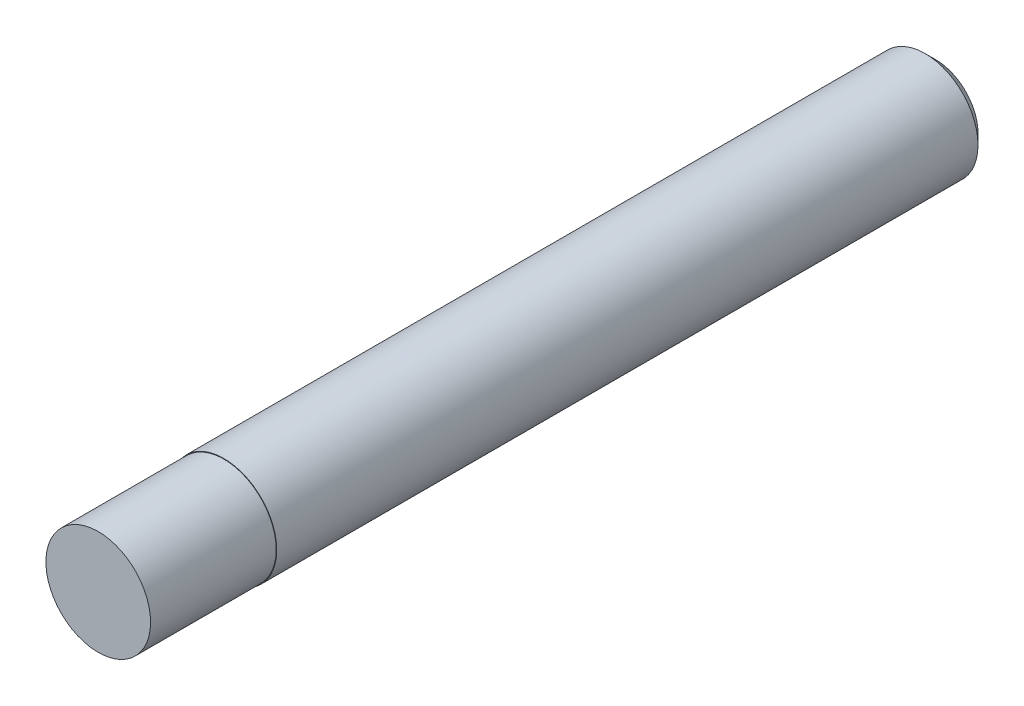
ISO-10303-21;
HEADER;
FILE_DESCRIPTION(('STEP AP214'),'2;1');
FILE_NAME('part.step','',(''),(''),'','','');
FILE_SCHEMA(('AUTOMOTIVE_DESIGN { 1 0 10303 214 1 1 1 1 }'));
ENDSEC;
DATA;
#1=APPLICATION_CONTEXT('core data for automotive mechanical design processes');
#2=APPLICATION_PROTOCOL_DEFINITION('international standard','automotive_design',2000,#1);
#3=PRODUCT_CONTEXT('',#1,'mechanical');
#4=PRODUCT('Part','Part','',(#3));
#5=PRODUCT_RELATED_PRODUCT_CATEGORY('part','',(#4));
#6=PRODUCT_DEFINITION_FORMATION('','',#4);
#7=PRODUCT_DEFINITION_CONTEXT('part definition',#1,'design');
#8=PRODUCT_DEFINITION('design','',#6,#7);
#9=PRODUCT_DEFINITION_SHAPE('','',#8);
#10=(LENGTH_UNIT() NAMED_UNIT(*) SI_UNIT(.MILLI.,.METRE.));
#11=(NAMED_UNIT(*) PLANE_ANGLE_UNIT() SI_UNIT($,.RADIAN.));
#12=(NAMED_UNIT(*) SI_UNIT($,.STERADIAN.) SOLID_ANGLE_UNIT());
#13=UNCERTAINTY_MEASURE_WITH_UNIT(LENGTH_MEASURE(1.E-05),#10,'distance_accuracy_value','');
#14=(GEOMETRIC_REPRESENTATION_CONTEXT(3) GLOBAL_UNCERTAINTY_ASSIGNED_CONTEXT((#13)) GLOBAL_UNIT_ASSIGNED_CONTEXT((#10,
#11,#12)) REPRESENTATION_CONTEXT('',''));
#15=CARTESIAN_POINT('',(0.,0.,0.));
#16=DIRECTION('',(0.,0.,1.));
#17=DIRECTION('',(1.,0.,0.));
#18=AXIS2_PLACEMENT_3D('',#15,#16,#17);
#19=CARTESIAN_POINT('',(0.,0.,34.));
#20=DIRECTION('',(0.,0.,1.));
#21=DIRECTION('',(1.,0.,0.));
#22=AXIS2_PLACEMENT_3D('',#19,#20,#21);
#23=PLANE('',#22);
#24=CARTESIAN_POINT('',(0.,0.,34.));
#25=DIRECTION('',(0.,0.,1.));
#26=DIRECTION('',(1.,0.,0.));
#27=AXIS2_PLACEMENT_3D('',#24,#25,#26);
#28=CIRCLE('',#27,2.525);
#29=CARTESIAN_POINT('',(2.525,0.,34.));
#30=VERTEX_POINT('',#29);
#31=EDGE_CURVE('E46',#30,#30,#28,.T.);
#32=ORIENTED_EDGE('',*,*,#31,.T.);
#33=EDGE_LOOP('',(#32));
#34=FACE_BOUND('',#33,.T.);
#35=CARTESIAN_POINT('',(0.,0.,34.));
#36=DIRECTION('',(0.,0.,1.));
#37=DIRECTION('',(1.,0.,0.));
#38=AXIS2_PLACEMENT_3D('',#35,#36,#37);
#39=CIRCLE('',#38,2.5);
#40=CARTESIAN_POINT('',(2.5,0.,34.));
#41=VERTEX_POINT('',#40);
#42=EDGE_CURVE('E53',#41,#41,#39,.T.);
#43=ORIENTED_EDGE('',*,*,#42,.F.);
#44=EDGE_LOOP('',(#43));
#45=FACE_BOUND('',#44,.T.);
#46=ADVANCED_FACE('F35',(#34,#45),#23,.T.);
#47=CARTESIAN_POINT('',(0.,0.,34.));
#48=DIRECTION('',(0.,0.,-1.));
#49=DIRECTION('',(-1.,0.,0.));
#50=AXIS2_PLACEMENT_3D('',#47,#48,#49);
#51=CYLINDRICAL_SURFACE('',#50,2.525);
#52=CARTESIAN_POINT('',(0.,0.,0.5));
#53=DIRECTION('',(0.,0.,1.));
#54=DIRECTION('',(1.,0.,0.));
#55=AXIS2_PLACEMENT_3D('',#52,#53,#54);
#56=CIRCLE('',#55,2.525);
#57=CARTESIAN_POINT('',(2.525,0.,0.5));
#58=VERTEX_POINT('',#57);
#59=EDGE_CURVE('E42',#58,#58,#56,.T.);
#60=ORIENTED_EDGE('',*,*,#59,.T.);
#61=EDGE_LOOP('',(#60));
#62=FACE_BOUND('',#61,.T.);
#63=ORIENTED_EDGE('',*,*,#31,.F.);
#64=EDGE_LOOP('',(#63));
#65=FACE_BOUND('',#64,.T.);
#66=ADVANCED_FACE('F69',(#62,#65),#51,.T.);
#67=CARTESIAN_POINT('',(0.,0.,0.));
#68=DIRECTION('',(0.,0.,1.));
#69=DIRECTION('',(1.,0.,0.));
#70=AXIS2_PLACEMENT_3D('',#67,#68,#69);
#71=PLANE('',#70);
#72=CARTESIAN_POINT('',(0.,0.,0.));
#73=DIRECTION('',(0.,0.,1.));
#74=DIRECTION('',(1.,0.,0.));
#75=AXIS2_PLACEMENT_3D('',#72,#73,#74);
#76=CIRCLE('',#75,2.025);
#77=CARTESIAN_POINT('',(2.025,0.,0.));
#78=VERTEX_POINT('',#77);
#79=EDGE_CURVE('E10',#78,#78,#76,.F.);
#80=ORIENTED_EDGE('',*,*,#79,.T.);
#81=EDGE_LOOP('',(#80));
#82=FACE_BOUND('',#81,.T.);
#83=ADVANCED_FACE('F64',(#82),#71,.F.);
#84=CARTESIAN_POINT('',(0.,0.,40.));
#85=DIRECTION('',(0.,0.,-1.));
#86=DIRECTION('',(-1.,0.,0.));
#87=AXIS2_PLACEMENT_3D('',#84,#85,#86);
#88=CYLINDRICAL_SURFACE('',#87,2.5);
#89=CARTESIAN_POINT('',(0.,0.,40.));
#90=DIRECTION('',(0.,0.,1.));
#91=DIRECTION('',(1.,0.,0.));
#92=AXIS2_PLACEMENT_3D('',#89,#90,#91);
#93=CIRCLE('',#92,2.5);
#94=CARTESIAN_POINT('',(2.5,0.,40.));
#95=VERTEX_POINT('',#94);
#96=EDGE_CURVE('E50',#95,#95,#93,.T.);
#97=ORIENTED_EDGE('',*,*,#96,.F.);
#98=EDGE_LOOP('',(#97));
#99=FACE_BOUND('',#98,.T.);
#100=ORIENTED_EDGE('',*,*,#42,.T.);
#101=EDGE_LOOP('',(#100));
#102=FACE_BOUND('',#101,.T.);
#103=ADVANCED_FACE('F61',(#99,#102),#88,.T.);
#104=CARTESIAN_POINT('',(0.,0.,40.));
#105=DIRECTION('',(0.,0.,1.));
#106=DIRECTION('',(1.,0.,0.));
#107=AXIS2_PLACEMENT_3D('',#104,#105,#106);
#108=PLANE('',#107);
#109=ORIENTED_EDGE('',*,*,#96,.T.);
#110=EDGE_LOOP('',(#109));
#111=FACE_BOUND('',#110,.T.);
#112=ADVANCED_FACE('F59',(#111),#108,.T.);
#113=CARTESIAN_POINT('',(0.,0.,0.5));
#114=DIRECTION('',(0.,0.,1.));
#115=DIRECTION('',(1.,0.,0.));
#116=AXIS2_PLACEMENT_3D('',#113,#114,#115);
#117=CONICAL_SURFACE('',#116,2.525,0.785398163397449);
#118=ORIENTED_EDGE('',*,*,#79,.F.);
#119=EDGE_LOOP('',(#118));
#120=FACE_BOUND('',#119,.T.);
#121=ORIENTED_EDGE('',*,*,#59,.F.);
#122=EDGE_LOOP('',(#121));
#123=FACE_BOUND('',#122,.T.);
#124=ADVANCED_FACE('F37',(#120,#123),#117,.T.);
#125=CLOSED_SHELL('',(#46,#66,#83,#103,#112,#124));
#126=MANIFOLD_SOLID_BREP('B2',#125);
#127=ADVANCED_BREP_SHAPE_REPRESENTATION('',(#18,#126),#14);
#128=SHAPE_DEFINITION_REPRESENTATION(#9,#127);
ENDSEC;
END-ISO-10303-21;
